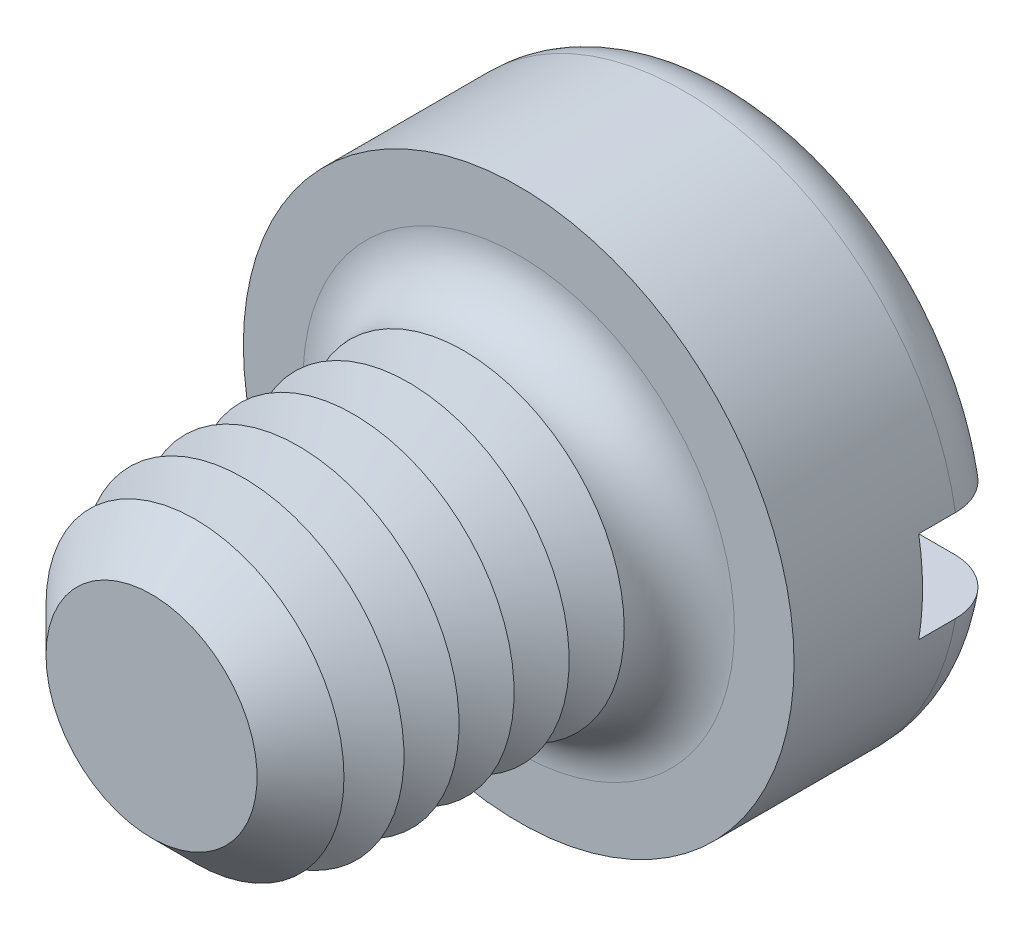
from build123d import *

# Parameters (mm, degrees)
SKETCH3_R           = 3
BOSS_EXTRUDE2_DEPTH = 2.4
SKETCH4_R           = 1.75
BOSS_EXTRUDE3_DEPTH = 4
FILLET1_R           = 0.6
CHAMFER1_SIZE       = 0.6
LPATTERN1_COUNT     = 5
LPATTERN1_PITCH     = 0.6
SKETCH8_W           = 6
SKETCH8_H           = 1
CUT_EXTRUDE1_DEPTH  = 1


with BuildPart() as part:
    # Sketch3 → Boss-Extrude2 (new body)
    with BuildSketch(Plane.XY):
        Circle(SKETCH3_R)
    extrude(amount=-BOSS_EXTRUDE2_DEPTH)

    # Sketch4 → Boss-Extrude3 (add)
    with BuildSketch(Plane.XY):
        Circle(SKETCH4_R)
    extrude(amount=BOSS_EXTRUDE3_DEPTH)

    # Fillet1
    fillet1_edges = [part.edges().sort_by_distance(p)[0] for p in [
        (-3, 0, -2.4),
        (-1.75, 0, 0),
    ]]
    fillet(fillet1_edges, radius=FILLET1_R)

    # Chamfer1
    chamfer1_edges = [part.edges().sort_by_distance(p)[0] for p in [
        (-1.75, 0, 4),
    ]]
    chamfer(chamfer1_edges, length=CHAMFER1_SIZE)

    # Sketch6 → Cut-Revolve1 (revolve, cut)
    with BuildSketch(Plane(origin=(0, 0, 0), x_dir=(0, 0, -1), z_dir=(1, 0, 0)), mode=Mode.PRIVATE) as cut_revolve1_sk:
        Polygon((-0.6, 1.75), (-0.9, 1.230384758), (-1.2, 1.75), align=None)
    cut_revolve1 = revolve(cut_revolve1_sk.sketch.rotate(Axis((0, 0, -1.694361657), (0, 0, 1)), 90), axis=Axis((0, 0, -1.694361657), (0, 0, 1)), mode=Mode.SUBTRACT)

    # LPattern1: Cut-Revolve1 ×5
    with Locations(*[(0, 0, i * LPATTERN1_PITCH) for i in range(1, LPATTERN1_COUNT)]):
        add(cut_revolve1, mode=Mode.SUBTRACT)

    # Sketch8 → Cut-Extrude1 (cut)
    with BuildSketch(Plane(origin=(0, 0, -2.4), x_dir=(-1, 0, 0), z_dir=(0, 0, -1))):
        Rectangle(SKETCH8_W, SKETCH8_H)
    extrude(amount=-CUT_EXTRUDE1_DEPTH, mode=Mode.SUBTRACT)


solid = part.part
